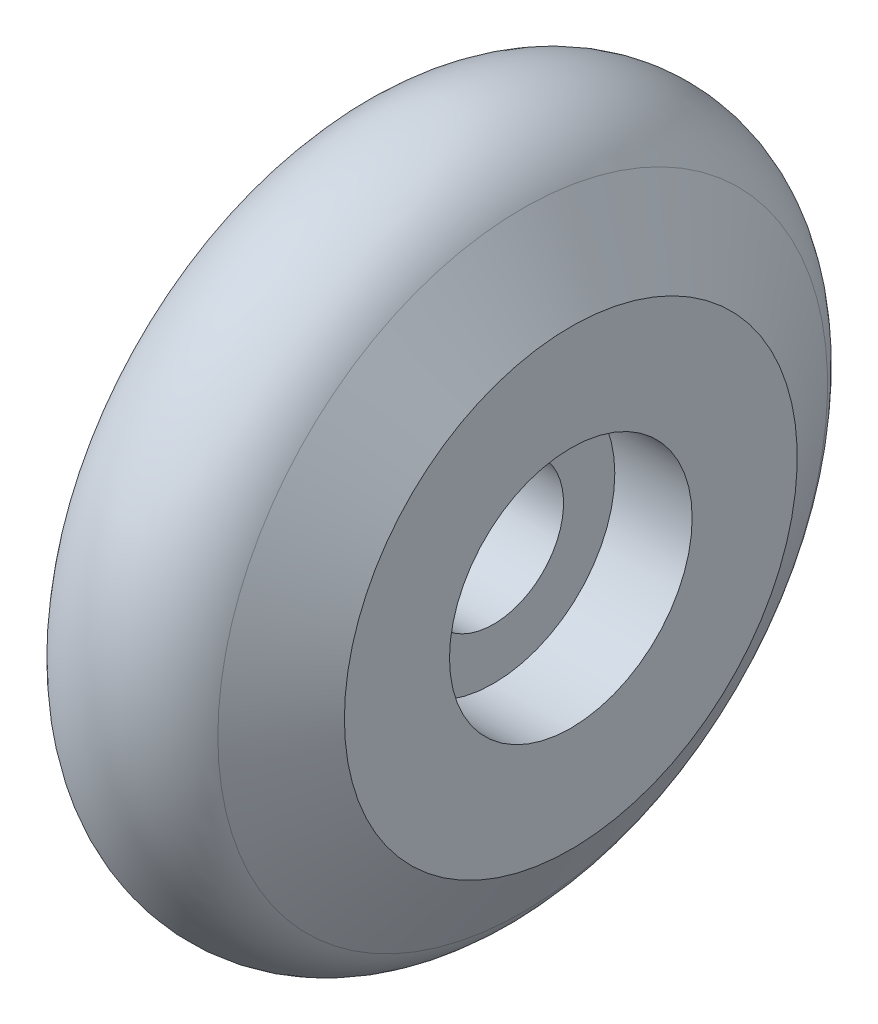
from build123d import *


with BuildPart() as part:
    # Sketch2 → Revolve1 (revolve)
    with BuildSketch(Plane.XY, mode=Mode.PRIVATE) as revolve1_sk:
        with BuildLine():
            Line((-4.9276, 6.35), (4.9276, 6.35))
            Line((4.9276, 6.35), (4.9276, 10.9982))
            Line((4.9276, 10.9982), (11.938, 10.9982))
            Line((11.938, 10.9982), (11.938, 20.5232))
            Line((11.938, 20.5232), (7.579143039, 27.633363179))
            ThreePointArc((7.579143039, 27.633363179), (0, 31.877), (-7.579143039, 27.633363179))
            Line((-7.579143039, 27.633363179), (-11.938, 20.5232))
            Line((-11.938, 20.5232), (-11.938, 10.9982))
            Line((-11.938, 10.9982), (-4.9276, 10.9982))
            Line((-4.9276, 10.9982), (-4.9276, 6.35))
        make_face()
    revolve(revolve1_sk.sketch.rotate(Axis((0, 0, 0), (1, 0, 0)), 90), axis=Axis((0, 0, 0), (1, 0, 0)))


solid = part.part
